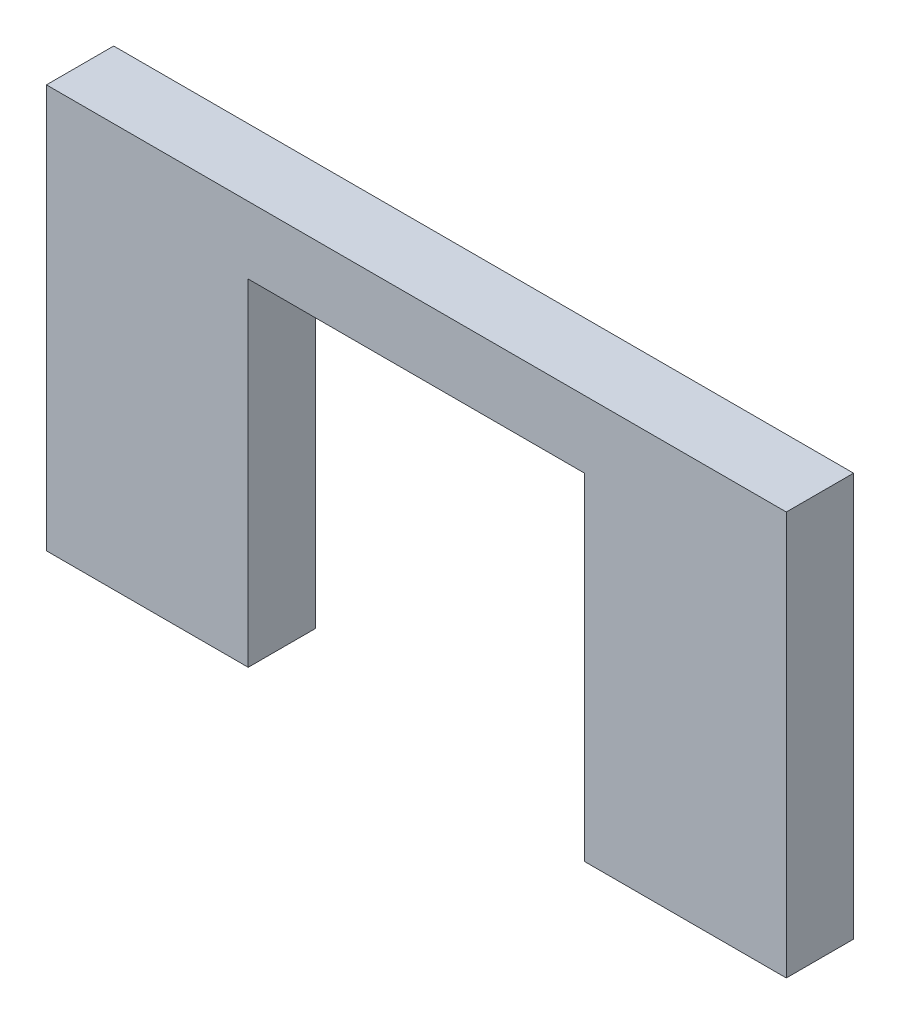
ISO-10303-21;
HEADER;
FILE_DESCRIPTION(('STEP AP214'),'2;1');
FILE_NAME('part.step','',(''),(''),'','','');
FILE_SCHEMA(('AUTOMOTIVE_DESIGN { 1 0 10303 214 1 1 1 1 }'));
ENDSEC;
DATA;
#1=APPLICATION_CONTEXT('core data for automotive mechanical design processes');
#2=APPLICATION_PROTOCOL_DEFINITION('international standard','automotive_design',2000,#1);
#3=PRODUCT_CONTEXT('',#1,'mechanical');
#4=PRODUCT('Part','Part','',(#3));
#5=PRODUCT_RELATED_PRODUCT_CATEGORY('part','',(#4));
#6=PRODUCT_DEFINITION_FORMATION('','',#4);
#7=PRODUCT_DEFINITION_CONTEXT('part definition',#1,'design');
#8=PRODUCT_DEFINITION('design','',#6,#7);
#9=PRODUCT_DEFINITION_SHAPE('','',#8);
#10=(LENGTH_UNIT() NAMED_UNIT(*) SI_UNIT(.MILLI.,.METRE.));
#11=(NAMED_UNIT(*) PLANE_ANGLE_UNIT() SI_UNIT($,.RADIAN.));
#12=(NAMED_UNIT(*) SI_UNIT($,.STERADIAN.) SOLID_ANGLE_UNIT());
#13=UNCERTAINTY_MEASURE_WITH_UNIT(LENGTH_MEASURE(1.E-05),#10,'distance_accuracy_value','');
#14=(GEOMETRIC_REPRESENTATION_CONTEXT(3) GLOBAL_UNCERTAINTY_ASSIGNED_CONTEXT((#13)) GLOBAL_UNIT_ASSIGNED_CONTEXT((#10,
#11,#12)) REPRESENTATION_CONTEXT('',''));
#15=CARTESIAN_POINT('',(0.,0.,0.));
#16=DIRECTION('',(0.,0.,1.));
#17=DIRECTION('',(1.,0.,0.));
#18=AXIS2_PLACEMENT_3D('',#15,#16,#17);
#19=CARTESIAN_POINT('',(0.,69.090909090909,20.));
#20=DIRECTION('',(0.,0.,1.));
#21=DIRECTION('',(1.,0.,0.));
#22=AXIS2_PLACEMENT_3D('',#19,#20,#21);
#23=PLANE('',#22);
#24=DIRECTION('',(1.,0.,0.));
#25=VECTOR('',#24,1.);
#26=CARTESIAN_POINT('',(-110.,0.,20.));
#27=LINE('',#26,#25);
#28=CARTESIAN_POINT('',(-110.,0.,20.));
#29=VERTEX_POINT('',#28);
#30=CARTESIAN_POINT('',(-50.,0.,20.));
#31=VERTEX_POINT('',#30);
#32=EDGE_CURVE('E145',#29,#31,#27,.T.);
#33=ORIENTED_EDGE('',*,*,#32,.T.);
#34=DIRECTION('',(0.,1.,0.));
#35=VECTOR('',#34,1.);
#36=CARTESIAN_POINT('',(-50.,0.,20.));
#37=LINE('',#36,#35);
#38=CARTESIAN_POINT('',(-50.,100.,20.));
#39=VERTEX_POINT('',#38);
#40=EDGE_CURVE('E124',#31,#39,#37,.T.);
#41=ORIENTED_EDGE('',*,*,#40,.T.);
#42=DIRECTION('',(1.,0.,0.));
#43=VECTOR('',#42,1.);
#44=CARTESIAN_POINT('',(-50.,100.,20.));
#45=LINE('',#44,#43);
#46=CARTESIAN_POINT('',(50.,100.,20.));
#47=VERTEX_POINT('',#46);
#48=EDGE_CURVE('E130',#39,#47,#45,.T.);
#49=ORIENTED_EDGE('',*,*,#48,.T.);
#50=DIRECTION('',(0.,-1.,0.));
#51=VECTOR('',#50,1.);
#52=CARTESIAN_POINT('',(50.,100.,20.));
#53=LINE('',#52,#51);
#54=CARTESIAN_POINT('',(50.,0.,20.));
#55=VERTEX_POINT('',#54);
#56=EDGE_CURVE('E153',#47,#55,#53,.T.);
#57=ORIENTED_EDGE('',*,*,#56,.T.);
#58=DIRECTION('',(1.,0.,0.));
#59=VECTOR('',#58,1.);
#60=CARTESIAN_POINT('',(50.,0.,20.));
#61=LINE('',#60,#59);
#62=CARTESIAN_POINT('',(110.,0.,20.));
#63=VERTEX_POINT('',#62);
#64=EDGE_CURVE('E159',#55,#63,#61,.T.);
#65=ORIENTED_EDGE('',*,*,#64,.T.);
#66=DIRECTION('',(0.,1.,0.));
#67=VECTOR('',#66,1.);
#68=CARTESIAN_POINT('',(110.,0.,20.));
#69=LINE('',#68,#67);
#70=CARTESIAN_POINT('',(110.,120.,20.));
#71=VERTEX_POINT('',#70);
#72=EDGE_CURVE('E86',#63,#71,#69,.T.);
#73=ORIENTED_EDGE('',*,*,#72,.T.);
#74=DIRECTION('',(-1.,0.,0.));
#75=VECTOR('',#74,1.);
#76=CARTESIAN_POINT('',(110.,120.,20.));
#77=LINE('',#76,#75);
#78=CARTESIAN_POINT('',(-110.,120.,20.));
#79=VERTEX_POINT('',#78);
#80=EDGE_CURVE('E185',#71,#79,#77,.T.);
#81=ORIENTED_EDGE('',*,*,#80,.T.);
#82=DIRECTION('',(0.,-1.,0.));
#83=VECTOR('',#82,1.);
#84=CARTESIAN_POINT('',(-110.,120.,20.));
#85=LINE('',#84,#83);
#86=EDGE_CURVE('E10',#79,#29,#85,.T.);
#87=ORIENTED_EDGE('',*,*,#86,.T.);
#88=EDGE_LOOP('',(#33,#41,#49,#57,#65,#73,#81,#87));
#89=FACE_BOUND('',#88,.T.);
#90=ADVANCED_FACE('F16',(#89),#23,.T.);
#91=CARTESIAN_POINT('',(0.,69.090909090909,0.));
#92=DIRECTION('',(0.,0.,1.));
#93=DIRECTION('',(1.,0.,0.));
#94=AXIS2_PLACEMENT_3D('',#91,#92,#93);
#95=PLANE('',#94);
#96=DIRECTION('',(0.,-1.,0.));
#97=VECTOR('',#96,1.);
#98=CARTESIAN_POINT('',(-110.,120.,0.));
#99=LINE('',#98,#97);
#100=CARTESIAN_POINT('',(-110.,120.,0.));
#101=VERTEX_POINT('',#100);
#102=CARTESIAN_POINT('',(-110.,0.,0.));
#103=VERTEX_POINT('',#102);
#104=EDGE_CURVE('E26',#101,#103,#99,.T.);
#105=ORIENTED_EDGE('',*,*,#104,.F.);
#106=DIRECTION('',(-1.,0.,0.));
#107=VECTOR('',#106,1.);
#108=CARTESIAN_POINT('',(110.,120.,0.));
#109=LINE('',#108,#107);
#110=CARTESIAN_POINT('',(110.,120.,0.));
#111=VERTEX_POINT('',#110);
#112=EDGE_CURVE('E73',#111,#101,#109,.T.);
#113=ORIENTED_EDGE('',*,*,#112,.F.);
#114=DIRECTION('',(0.,1.,0.));
#115=VECTOR('',#114,1.);
#116=CARTESIAN_POINT('',(110.,0.,0.));
#117=LINE('',#116,#115);
#118=CARTESIAN_POINT('',(110.,0.,0.));
#119=VERTEX_POINT('',#118);
#120=EDGE_CURVE('E164',#119,#111,#117,.T.);
#121=ORIENTED_EDGE('',*,*,#120,.F.);
#122=DIRECTION('',(1.,0.,0.));
#123=VECTOR('',#122,1.);
#124=CARTESIAN_POINT('',(50.,0.,0.));
#125=LINE('',#124,#123);
#126=CARTESIAN_POINT('',(50.,0.,0.));
#127=VERTEX_POINT('',#126);
#128=EDGE_CURVE('E160',#127,#119,#125,.T.);
#129=ORIENTED_EDGE('',*,*,#128,.F.);
#130=DIRECTION('',(0.,-1.,0.));
#131=VECTOR('',#130,1.);
#132=CARTESIAN_POINT('',(50.,100.,0.));
#133=LINE('',#132,#131);
#134=CARTESIAN_POINT('',(50.,100.,0.));
#135=VERTEX_POINT('',#134);
#136=EDGE_CURVE('E118',#135,#127,#133,.T.);
#137=ORIENTED_EDGE('',*,*,#136,.F.);
#138=DIRECTION('',(1.,0.,0.));
#139=VECTOR('',#138,1.);
#140=CARTESIAN_POINT('',(-50.,100.,0.));
#141=LINE('',#140,#139);
#142=CARTESIAN_POINT('',(-50.,100.,0.));
#143=VERTEX_POINT('',#142);
#144=EDGE_CURVE('E110',#143,#135,#141,.T.);
#145=ORIENTED_EDGE('',*,*,#144,.F.);
#146=DIRECTION('',(0.,1.,0.));
#147=VECTOR('',#146,1.);
#148=CARTESIAN_POINT('',(-50.,0.,0.));
#149=LINE('',#148,#147);
#150=CARTESIAN_POINT('',(-50.,0.,0.));
#151=VERTEX_POINT('',#150);
#152=EDGE_CURVE('E115',#151,#143,#149,.T.);
#153=ORIENTED_EDGE('',*,*,#152,.F.);
#154=DIRECTION('',(1.,0.,0.));
#155=VECTOR('',#154,1.);
#156=CARTESIAN_POINT('',(-110.,0.,0.));
#157=LINE('',#156,#155);
#158=EDGE_CURVE('E193',#103,#151,#157,.T.);
#159=ORIENTED_EDGE('',*,*,#158,.F.);
#160=EDGE_LOOP('',(#105,#113,#121,#129,#137,#145,#153,#159));
#161=FACE_BOUND('',#160,.T.);
#162=ADVANCED_FACE('F112',(#161),#95,.F.);
#163=CARTESIAN_POINT('',(-110.,120.,0.));
#164=DIRECTION('',(1.,0.,0.));
#165=DIRECTION('',(0.,1.,0.));
#166=AXIS2_PLACEMENT_3D('',#163,#164,#165);
#167=PLANE('',#166);
#168=ORIENTED_EDGE('',*,*,#104,.T.);
#169=DIRECTION('',(0.,0.,1.));
#170=VECTOR('',#169,1.);
#171=CARTESIAN_POINT('',(-110.,0.,0.));
#172=LINE('',#171,#170);
#173=EDGE_CURVE('E140',#103,#29,#172,.T.);
#174=ORIENTED_EDGE('',*,*,#173,.T.);
#175=ORIENTED_EDGE('',*,*,#86,.F.);
#176=DIRECTION('',(0.,0.,1.));
#177=VECTOR('',#176,1.);
#178=CARTESIAN_POINT('',(-110.,120.,0.));
#179=LINE('',#178,#177);
#180=EDGE_CURVE('E181',#101,#79,#179,.T.);
#181=ORIENTED_EDGE('',*,*,#180,.F.);
#182=EDGE_LOOP('',(#168,#174,#175,#181));
#183=FACE_BOUND('',#182,.T.);
#184=ADVANCED_FACE('F18',(#183),#167,.F.);
#185=CARTESIAN_POINT('',(110.,120.,0.));
#186=DIRECTION('',(0.,-1.,0.));
#187=DIRECTION('',(0.,0.,-1.));
#188=AXIS2_PLACEMENT_3D('',#185,#186,#187);
#189=PLANE('',#188);
#190=ORIENTED_EDGE('',*,*,#112,.T.);
#191=ORIENTED_EDGE('',*,*,#180,.T.);
#192=ORIENTED_EDGE('',*,*,#80,.F.);
#193=DIRECTION('',(0.,0.,1.));
#194=VECTOR('',#193,1.);
#195=CARTESIAN_POINT('',(110.,120.,0.));
#196=LINE('',#195,#194);
#197=EDGE_CURVE('E161',#111,#71,#196,.T.);
#198=ORIENTED_EDGE('',*,*,#197,.F.);
#199=EDGE_LOOP('',(#190,#191,#192,#198));
#200=FACE_BOUND('',#199,.T.);
#201=ADVANCED_FACE('F217',(#200),#189,.F.);
#202=CARTESIAN_POINT('',(110.,0.,0.));
#203=DIRECTION('',(-1.,0.,0.));
#204=DIRECTION('',(0.,0.,1.));
#205=AXIS2_PLACEMENT_3D('',#202,#203,#204);
#206=PLANE('',#205);
#207=ORIENTED_EDGE('',*,*,#120,.T.);
#208=ORIENTED_EDGE('',*,*,#197,.T.);
#209=ORIENTED_EDGE('',*,*,#72,.F.);
#210=DIRECTION('',(0.,0.,1.));
#211=VECTOR('',#210,1.);
#212=CARTESIAN_POINT('',(110.,0.,0.));
#213=LINE('',#212,#211);
#214=EDGE_CURVE('E155',#119,#63,#213,.T.);
#215=ORIENTED_EDGE('',*,*,#214,.F.);
#216=EDGE_LOOP('',(#207,#208,#209,#215));
#217=FACE_BOUND('',#216,.T.);
#218=ADVANCED_FACE('F215',(#217),#206,.F.);
#219=CARTESIAN_POINT('',(50.,0.,0.));
#220=DIRECTION('',(0.,1.,0.));
#221=DIRECTION('',(1.,0.,0.));
#222=AXIS2_PLACEMENT_3D('',#219,#220,#221);
#223=PLANE('',#222);
#224=ORIENTED_EDGE('',*,*,#128,.T.);
#225=ORIENTED_EDGE('',*,*,#214,.T.);
#226=ORIENTED_EDGE('',*,*,#64,.F.);
#227=DIRECTION('',(0.,0.,1.));
#228=VECTOR('',#227,1.);
#229=CARTESIAN_POINT('',(50.,0.,0.));
#230=LINE('',#229,#228);
#231=EDGE_CURVE('E149',#127,#55,#230,.T.);
#232=ORIENTED_EDGE('',*,*,#231,.F.);
#233=EDGE_LOOP('',(#224,#225,#226,#232));
#234=FACE_BOUND('',#233,.T.);
#235=ADVANCED_FACE('F214',(#234),#223,.F.);
#236=CARTESIAN_POINT('',(50.,100.,0.));
#237=DIRECTION('',(1.,0.,0.));
#238=DIRECTION('',(0.,1.,0.));
#239=AXIS2_PLACEMENT_3D('',#236,#237,#238);
#240=PLANE('',#239);
#241=ORIENTED_EDGE('',*,*,#136,.T.);
#242=ORIENTED_EDGE('',*,*,#231,.T.);
#243=ORIENTED_EDGE('',*,*,#56,.F.);
#244=DIRECTION('',(0.,0.,1.));
#245=VECTOR('',#244,1.);
#246=CARTESIAN_POINT('',(50.,100.,0.));
#247=LINE('',#246,#245);
#248=EDGE_CURVE('E123',#135,#47,#247,.T.);
#249=ORIENTED_EDGE('',*,*,#248,.F.);
#250=EDGE_LOOP('',(#241,#242,#243,#249));
#251=FACE_BOUND('',#250,.T.);
#252=ADVANCED_FACE('F212',(#251),#240,.F.);
#253=CARTESIAN_POINT('',(-50.,100.,0.));
#254=DIRECTION('',(0.,1.,0.));
#255=DIRECTION('',(1.,0.,0.));
#256=AXIS2_PLACEMENT_3D('',#253,#254,#255);
#257=PLANE('',#256);
#258=ORIENTED_EDGE('',*,*,#144,.T.);
#259=ORIENTED_EDGE('',*,*,#248,.T.);
#260=ORIENTED_EDGE('',*,*,#48,.F.);
#261=DIRECTION('',(0.,0.,1.));
#262=VECTOR('',#261,1.);
#263=CARTESIAN_POINT('',(-50.,100.,0.));
#264=LINE('',#263,#262);
#265=EDGE_CURVE('E127',#143,#39,#264,.T.);
#266=ORIENTED_EDGE('',*,*,#265,.F.);
#267=EDGE_LOOP('',(#258,#259,#260,#266));
#268=FACE_BOUND('',#267,.T.);
#269=ADVANCED_FACE('F128',(#268),#257,.F.);
#270=CARTESIAN_POINT('',(-50.,0.,0.));
#271=DIRECTION('',(-1.,0.,0.));
#272=DIRECTION('',(0.,0.,1.));
#273=AXIS2_PLACEMENT_3D('',#270,#271,#272);
#274=PLANE('',#273);
#275=ORIENTED_EDGE('',*,*,#152,.T.);
#276=ORIENTED_EDGE('',*,*,#265,.T.);
#277=ORIENTED_EDGE('',*,*,#40,.F.);
#278=DIRECTION('',(0.,0.,1.));
#279=VECTOR('',#278,1.);
#280=CARTESIAN_POINT('',(-50.,0.,0.));
#281=LINE('',#280,#279);
#282=EDGE_CURVE('E137',#151,#31,#281,.T.);
#283=ORIENTED_EDGE('',*,*,#282,.F.);
#284=EDGE_LOOP('',(#275,#276,#277,#283));
#285=FACE_BOUND('',#284,.T.);
#286=ADVANCED_FACE('F135',(#285),#274,.F.);
#287=CARTESIAN_POINT('',(-110.,0.,0.));
#288=DIRECTION('',(0.,1.,0.));
#289=DIRECTION('',(1.,0.,0.));
#290=AXIS2_PLACEMENT_3D('',#287,#288,#289);
#291=PLANE('',#290);
#292=ORIENTED_EDGE('',*,*,#158,.T.);
#293=ORIENTED_EDGE('',*,*,#282,.T.);
#294=ORIENTED_EDGE('',*,*,#32,.F.);
#295=ORIENTED_EDGE('',*,*,#173,.F.);
#296=EDGE_LOOP('',(#292,#293,#294,#295));
#297=FACE_BOUND('',#296,.T.);
#298=ADVANCED_FACE('F192',(#297),#291,.F.);
#299=CLOSED_SHELL('',(#90,#162,#184,#201,#218,#235,#252,#269,#286,#298));
#300=MANIFOLD_SOLID_BREP('B1',#299);
#301=ADVANCED_BREP_SHAPE_REPRESENTATION('',(#18,#300),#14);
#302=SHAPE_DEFINITION_REPRESENTATION(#9,#301);
ENDSEC;
END-ISO-10303-21;
